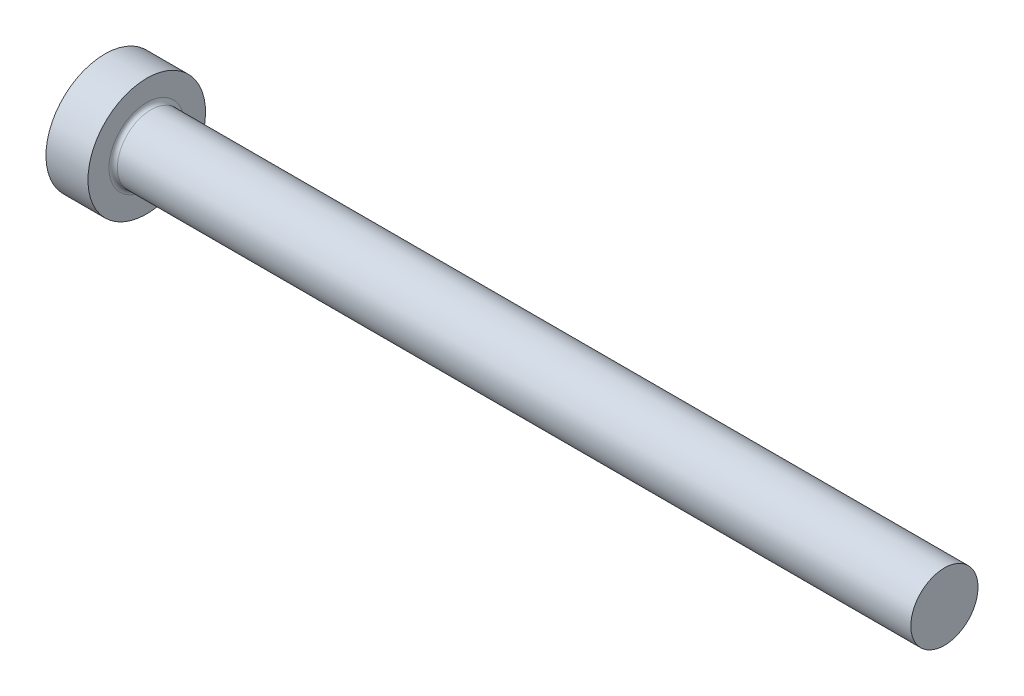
ISO-10303-21;
HEADER;
FILE_DESCRIPTION(('STEP AP214'),'2;1');
FILE_NAME('part.step','',(''),(''),'','','');
FILE_SCHEMA(('AUTOMOTIVE_DESIGN { 1 0 10303 214 1 1 1 1 }'));
ENDSEC;
DATA;
#1=APPLICATION_CONTEXT('core data for automotive mechanical design processes');
#2=APPLICATION_PROTOCOL_DEFINITION('international standard','automotive_design',2000,#1);
#3=PRODUCT_CONTEXT('',#1,'mechanical');
#4=PRODUCT('Part','Part','',(#3));
#5=PRODUCT_RELATED_PRODUCT_CATEGORY('part','',(#4));
#6=PRODUCT_DEFINITION_FORMATION('','',#4);
#7=PRODUCT_DEFINITION_CONTEXT('part definition',#1,'design');
#8=PRODUCT_DEFINITION('design','',#6,#7);
#9=PRODUCT_DEFINITION_SHAPE('','',#8);
#10=(LENGTH_UNIT() NAMED_UNIT(*) SI_UNIT(.MILLI.,.METRE.));
#11=(NAMED_UNIT(*) PLANE_ANGLE_UNIT() SI_UNIT($,.RADIAN.));
#12=(NAMED_UNIT(*) SI_UNIT($,.STERADIAN.) SOLID_ANGLE_UNIT());
#13=UNCERTAINTY_MEASURE_WITH_UNIT(LENGTH_MEASURE(1.E-05),#10,'distance_accuracy_value','');
#14=(GEOMETRIC_REPRESENTATION_CONTEXT(3) GLOBAL_UNCERTAINTY_ASSIGNED_CONTEXT((#13)) GLOBAL_UNIT_ASSIGNED_CONTEXT((#10,
#11,#12)) REPRESENTATION_CONTEXT('',''));
#15=CARTESIAN_POINT('',(0.,0.,0.));
#16=DIRECTION('',(0.,0.,1.));
#17=DIRECTION('',(1.,0.,0.));
#18=AXIS2_PLACEMENT_3D('',#15,#16,#17);
#19=CARTESIAN_POINT('',(0.,0.,0.));
#20=DIRECTION('',(-1.,0.,0.));
#21=DIRECTION('',(0.,-1.,0.));
#22=AXIS2_PLACEMENT_3D('',#19,#20,#21);
#23=PLANE('',#22);
#24=CARTESIAN_POINT('',(0.,0.,0.));
#25=DIRECTION('',(1.,0.,0.));
#26=DIRECTION('',(0.,1.,0.));
#27=AXIS2_PLACEMENT_3D('',#24,#25,#26);
#28=CIRCLE('',#27,7.);
#29=CARTESIAN_POINT('',(0.,7.,0.));
#30=VERTEX_POINT('',#29);
#31=EDGE_CURVE('E25',#30,#30,#28,.T.);
#32=ORIENTED_EDGE('',*,*,#31,.F.);
#33=EDGE_LOOP('',(#32));
#34=FACE_BOUND('',#33,.T.);
#35=ADVANCED_FACE('F14',(#34),#23,.T.);
#36=CARTESIAN_POINT('',(100.,0.,0.));
#37=DIRECTION('',(1.,0.,0.));
#38=DIRECTION('',(0.,1.,0.));
#39=AXIS2_PLACEMENT_3D('',#36,#37,#38);
#40=CYLINDRICAL_SURFACE('',#39,7.);
#41=ORIENTED_EDGE('',*,*,#31,.T.);
#42=EDGE_LOOP('',(#41));
#43=FACE_BOUND('',#42,.T.);
#44=CARTESIAN_POINT('',(5.,0.,0.));
#45=DIRECTION('',(1.,0.,0.));
#46=DIRECTION('',(0.,1.,0.));
#47=AXIS2_PLACEMENT_3D('',#44,#45,#46);
#48=CIRCLE('',#47,7.);
#49=CARTESIAN_POINT('',(5.,7.,0.));
#50=VERTEX_POINT('',#49);
#51=EDGE_CURVE('E29',#50,#50,#48,.T.);
#52=ORIENTED_EDGE('',*,*,#51,.F.);
#53=EDGE_LOOP('',(#52));
#54=FACE_BOUND('',#53,.T.);
#55=ADVANCED_FACE('F51',(#43,#54),#40,.T.);
#56=CARTESIAN_POINT('',(5.,7.,0.));
#57=DIRECTION('',(1.,0.,0.));
#58=DIRECTION('',(0.,1.,0.));
#59=AXIS2_PLACEMENT_3D('',#56,#57,#58);
#60=PLANE('',#59);
#61=CARTESIAN_POINT('',(5.,0.,0.));
#62=DIRECTION('',(1.,0.,0.));
#63=DIRECTION('',(0.,1.,0.));
#64=AXIS2_PLACEMENT_3D('',#61,#62,#63);
#65=CIRCLE('',#64,4.5);
#66=CARTESIAN_POINT('',(5.,4.5,0.));
#67=VERTEX_POINT('',#66);
#68=EDGE_CURVE('E9',#67,#67,#65,.F.);
#69=ORIENTED_EDGE('',*,*,#68,.T.);
#70=EDGE_LOOP('',(#69));
#71=FACE_BOUND('',#70,.T.);
#72=ORIENTED_EDGE('',*,*,#51,.T.);
#73=EDGE_LOOP('',(#72));
#74=FACE_BOUND('',#73,.T.);
#75=ADVANCED_FACE('F42',(#71,#74),#60,.T.);
#76=CARTESIAN_POINT('',(100.,0.,0.));
#77=DIRECTION('',(1.,0.,0.));
#78=DIRECTION('',(0.,1.,0.));
#79=AXIS2_PLACEMENT_3D('',#76,#77,#78);
#80=CYLINDRICAL_SURFACE('',#79,4.);
#81=CARTESIAN_POINT('',(5.5,0.,0.));
#82=DIRECTION('',(1.,0.,0.));
#83=DIRECTION('',(0.,1.,0.));
#84=AXIS2_PLACEMENT_3D('',#81,#82,#83);
#85=CIRCLE('',#84,4.);
#86=CARTESIAN_POINT('',(5.5,4.,0.));
#87=VERTEX_POINT('',#86);
#88=EDGE_CURVE('E21',#87,#87,#85,.T.);
#89=ORIENTED_EDGE('',*,*,#88,.T.);
#90=EDGE_LOOP('',(#89));
#91=FACE_BOUND('',#90,.T.);
#92=CARTESIAN_POINT('',(100.,0.,0.));
#93=DIRECTION('',(1.,0.,0.));
#94=DIRECTION('',(0.,1.,0.));
#95=AXIS2_PLACEMENT_3D('',#92,#93,#94);
#96=CIRCLE('',#95,4.);
#97=CARTESIAN_POINT('',(100.,3.99999999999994,0.));
#98=VERTEX_POINT('',#97);
#99=EDGE_CURVE('E34',#98,#98,#96,.T.);
#100=ORIENTED_EDGE('',*,*,#99,.F.);
#101=EDGE_LOOP('',(#100));
#102=FACE_BOUND('',#101,.T.);
#103=ADVANCED_FACE('F40',(#91,#102),#80,.T.);
#104=CARTESIAN_POINT('',(100.,3.99999999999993,0.));
#105=DIRECTION('',(1.,0.,0.));
#106=DIRECTION('',(0.,1.,0.));
#107=AXIS2_PLACEMENT_3D('',#104,#105,#106);
#108=PLANE('',#107);
#109=ORIENTED_EDGE('',*,*,#99,.T.);
#110=EDGE_LOOP('',(#109));
#111=FACE_BOUND('',#110,.T.);
#112=ADVANCED_FACE('F38',(#111),#108,.T.);
#113=CARTESIAN_POINT('',(5.5,0.,0.));
#114=DIRECTION('',(1.,0.,0.));
#115=DIRECTION('',(0.,1.,0.));
#116=AXIS2_PLACEMENT_3D('',#113,#114,#115);
#117=TOROIDAL_SURFACE('',#116,4.5,0.5);
#118=ORIENTED_EDGE('',*,*,#68,.F.);
#119=EDGE_LOOP('',(#118));
#120=FACE_BOUND('',#119,.T.);
#121=ORIENTED_EDGE('',*,*,#88,.F.);
#122=EDGE_LOOP('',(#121));
#123=FACE_BOUND('',#122,.T.);
#124=ADVANCED_FACE('F16',(#120,#123),#117,.F.);
#125=CLOSED_SHELL('',(#35,#55,#75,#103,#112,#124));
#126=MANIFOLD_SOLID_BREP('B1',#125);
#127=ADVANCED_BREP_SHAPE_REPRESENTATION('',(#18,#126),#14);
#128=SHAPE_DEFINITION_REPRESENTATION(#9,#127);
ENDSEC;
END-ISO-10303-21;
